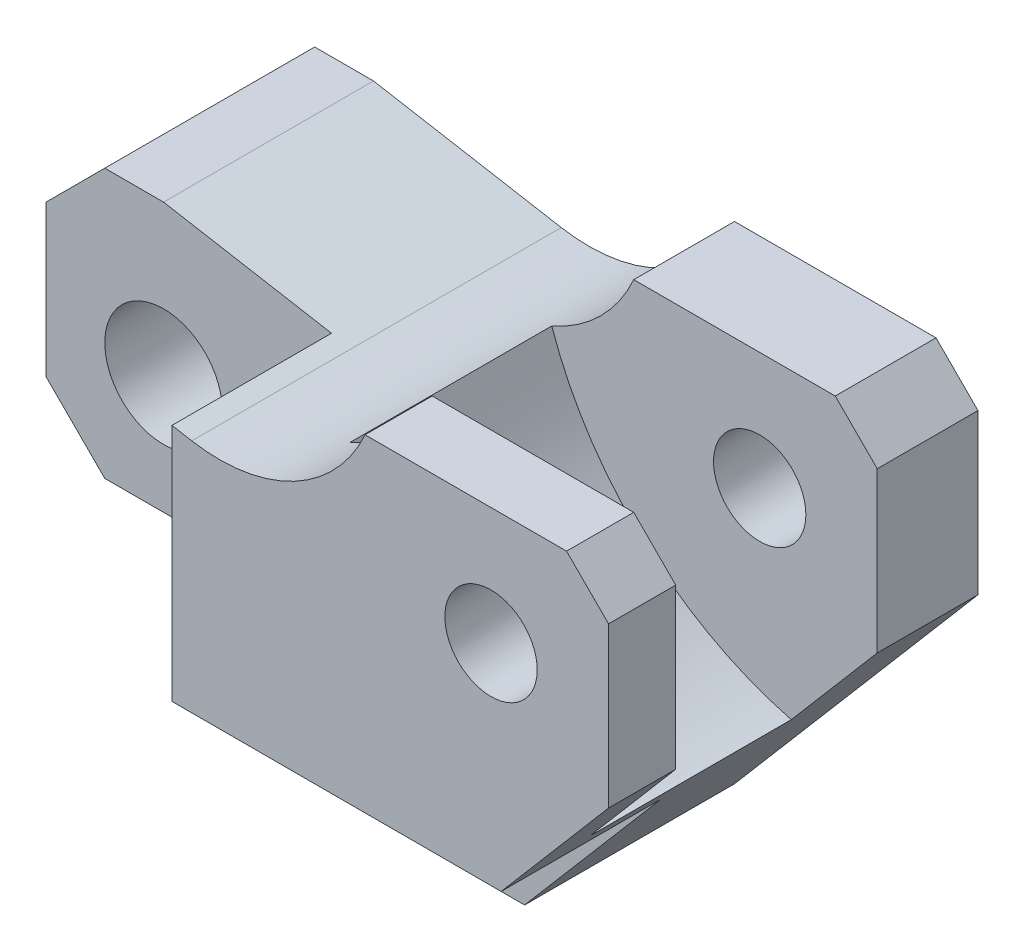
from build123d import *

# Parameters (mm, degrees)
ESQUISSE1_R                  = 7
BOSS_EXTRU_1_DEPTH           = 44
ENL_V_MAT_EXTRU_1_DEPTH      = 19
ENL_V_START                  = -12
ENL_V_MAT_EXTRU_2_DEPTH      = 24
ENL_V_MAT_EXTRU_3_DEPTH      = 63
ENL_V_MAT_EXTRU_3_DEPTH_BACK = 90
ESQUISSE5_R                  = 5.5


with BuildPart() as part:
    # Esquisse1 → Boss.-Extru.1 (new body)
    with BuildSketch(Plane.XY):
        with BuildLine():
            Line((15.50211583, 28.625528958), (39.50211583, 28.625528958))
            Line((39.50211583, 28.625528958), (44.50211583, 23.625528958))
            Line((44.50211583, 23.625528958), (44.50211583, 4.625528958))
            Line((44.50211583, 4.625528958), (15.50211583, -29.374471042))
            Line((15.50211583, -29.374471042), (9.799095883, -29.374471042))
            ThreePointArc((9.799095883, -29.374471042), (5.360123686, -22.490143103), (3.023293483, -14.639176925))
            ThreePointArc((3.023293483, -14.639176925), (1.342890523, -11.58788481), (-1.922345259, -10.374471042))
            Line((-1.922345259, -10.374471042), (-34.49788417, -10.374471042))
            Line((-34.49788417, -10.374471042), (-41.49788417, -3.374471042))
            Line((-41.49788417, -3.374471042), (-41.49788417, 14.625528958))
            Line((-41.49788417, 14.625528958), (-34.49788417, 21.625528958))
            Line((-34.49788417, 21.625528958), (-27.49788417, 21.625528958))
            Line((-27.49788417, 21.625528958), (-5.136503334, 17.68261419))
            ThreePointArc((-5.136503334, 17.68261419), (7.063214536, 19.6075731), (15.50211583, 28.625528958))
        make_face()
        with Locations((-27.49788417, 3.625528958)):
            Circle(ESQUISSE1_R, mode=Mode.SUBTRACT)
    extrude(amount=BOSS_EXTRU_1_DEPTH)

    # Esquisse2 → Enl_v. mat.-Extru.1 (cut)
    with BuildSketch(Plane.XY.offset(44)):
        Polygon((-7.49788417, 18.098989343), (-7.49788417, -10.374471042), (44.50211583, -10.374471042), (44.50211583, -36.793659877), (-46.053846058, -36.793659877), (-46.053846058, 29.579498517), (-7.49788417, 29.579498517), align=None)
    extrude(amount=-ENL_V_MAT_EXTRU_1_DEPTH, mode=Mode.SUBTRACT)

    # Esquisse4 → Enl_v. mat.-Extru.2 (cut)
    with BuildSketch(Plane(origin=(0, 0, 0), x_dir=(-1, 0, 0), z_dir=(0, 0, -1)).offset(ENL_V_START)):
        with BuildLine():
            Line((-15.50211583, 28.625528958), (-39.50211583, 28.625528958))
            Line((-39.50211583, 28.625528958), (-44.50211583, 23.625528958))
            Line((-44.50211583, 23.625528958), (-44.50211583, 4.625528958))
            Line((-44.50211583, 4.625528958), (-34.266821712, -7.374471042))
            ThreePointArc((-34.266821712, -7.374471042), (-16.686378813, 2.206234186), (-5.739052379, 18.969823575))
            ThreePointArc((-5.739052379, 18.969823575), (-11.523360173, 22.884862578), (-15.50211583, 28.625528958))
        make_face()
    extrude(amount=-ENL_V_MAT_EXTRU_2_DEPTH, mode=Mode.SUBTRACT)

    # Esquisse5 → Enl_v. mat.-Extru.3 (cut, two sides: drawn at the far end of the back side and taken through both)
    with BuildSketch(Plane.XY.offset(44).offset(-ENL_V_MAT_EXTRU_3_DEPTH_BACK)):
        with Locations((30.50211583, 14.625528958)):
            Circle(ESQUISSE5_R)
    extrude(amount=ENL_V_MAT_EXTRU_3_DEPTH + ENL_V_MAT_EXTRU_3_DEPTH_BACK, mode=Mode.SUBTRACT)


solid = part.part
